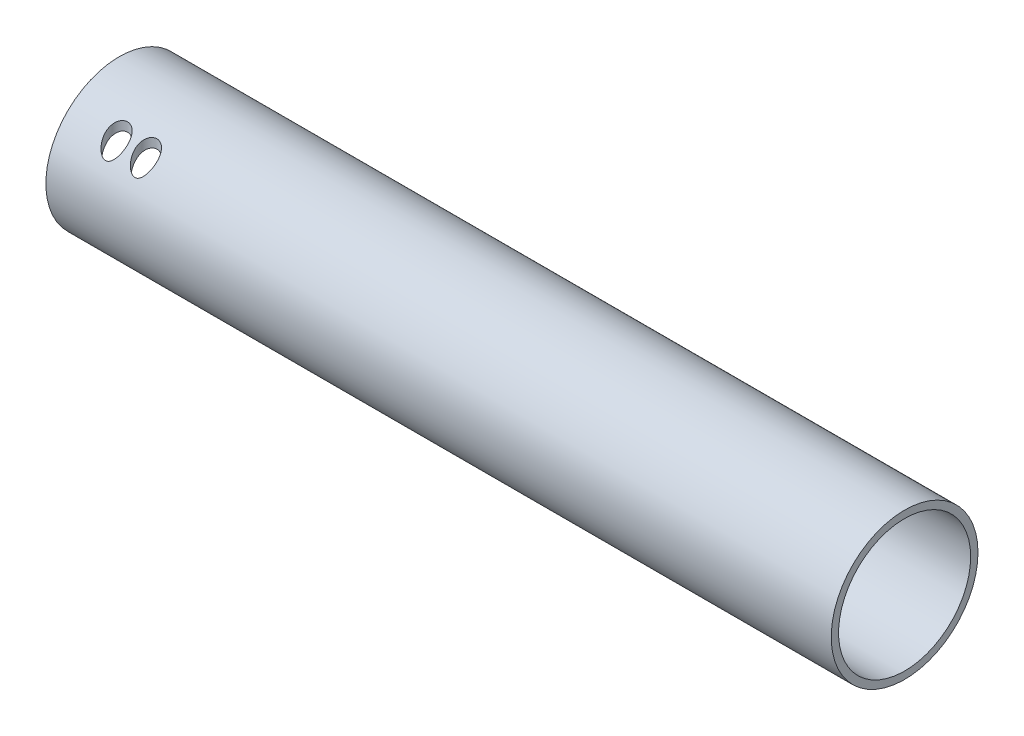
from build123d import *

# Parameters (mm, degrees)
SKETCH1_R           = 20
BOSS_EXTRUDE1_DEPTH = 214
SKETCH2_R           = 18
CUT_EXTRUDE1_DEPTH  = 214
SKETCH4_R           = 3
CUT_EXTRUDE3_DEPTH  = 18
CUT_EXTRUDE4_DEPTH  = 32


with BuildPart() as part:
    # Sketch1 → Boss-Extrude1 (new body)
    with BuildSketch(Plane(origin=(0, 0, 0), x_dir=(0, 0, -1), z_dir=(1, 0, 0))):
        Circle(SKETCH1_R)
    extrude(amount=BOSS_EXTRUDE1_DEPTH)

    # Sketch2 → Cut-Extrude1 (cut)
    with BuildSketch(Plane(origin=(214, 0, 0), x_dir=(0, 0, -1), z_dir=(1, 0, 0))):
        Circle(SKETCH2_R)
    extrude(amount=-CUT_EXTRUDE1_DEPTH, mode=Mode.SUBTRACT)

    # Sketch4 → Cut-Extrude3 (cut)
    with BuildSketch(Plane(origin=(0, 0, 0), x_dir=(1, 0, 0), z_dir=(0, 1, 0))):
        with Locations(Location((13.244791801, -13.975079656, 0), (0, 0, 90))):
            Circle(SKETCH4_R)
        with Locations(Location((21.244791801, -13.975079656, 0), (0, 0, 90))):
            Circle(SKETCH4_R)
    extrude(amount=CUT_EXTRUDE3_DEPTH, mode=Mode.SUBTRACT)

    # Sketch5 → Cut-Extrude4 (cut)
    with BuildSketch(Plane.XY.offset(10)):
        with BuildLine():
            Line((163, 5), (178, 5))
            ThreePointArc((178, 5), (179.767766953, 4.267766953), (180.5, 2.5))
            Line((180.5, 2.5), (180.5, -2.5))
            ThreePointArc((180.5, -2.5), (179.767766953, -4.267766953), (178, -5))
            Line((178, -5), (163, -5))
            ThreePointArc((163, -5), (161.232233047, -4.267766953), (160.5, -2.5))
            Line((160.5, -2.5), (160.5, 0))
            Line((160.5, 0), (160.5, 2.5))
            ThreePointArc((160.5, 2.5), (161.232233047, 4.267766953), (163, 5))
        make_face()
    extrude(amount=-CUT_EXTRUDE4_DEPTH, mode=Mode.SUBTRACT)


solid = part.part
